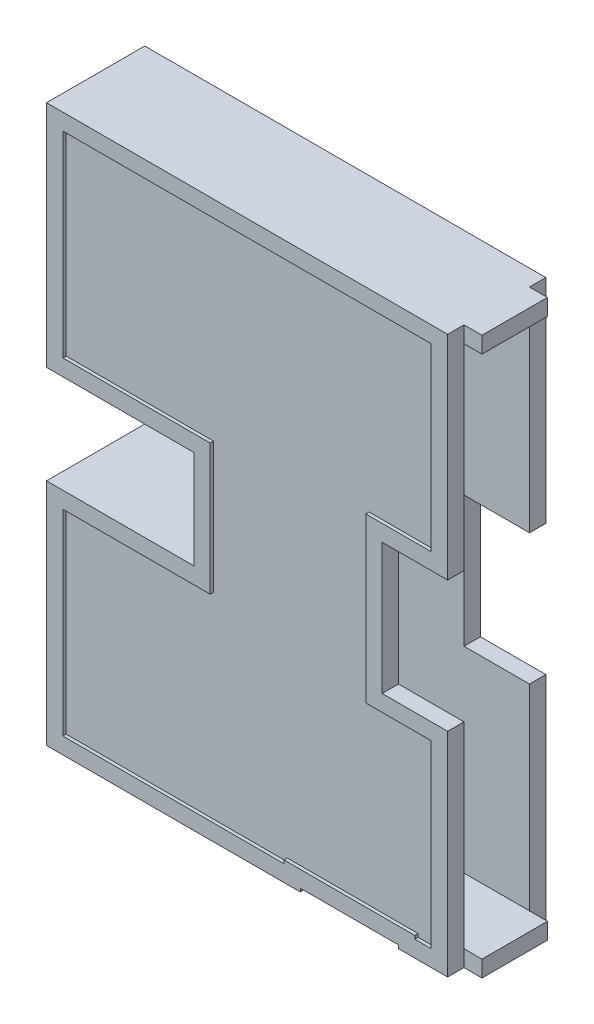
from build123d import *

# Parameters (mm, degrees)
BOSS_EXTRU_1_DEPTH      = 15
ENL_V_MAT_EXTRU_1_DEPTH = 1
ESQUISSE3_W             = 20
ESQUISSE3_H             = 160
ENL_V_MAT_EXTRU_2_DEPTH = 78
ESQUISSE4_W             = 20
ESQUISSE4_H             = 60
ENL_V_MAT_EXTRU_3_DEPTH = 45
ESQUISSE5_W             = 5.5
ESQUISSE5_H             = 5
ENL_V_MAT_EXTRU_4_DEPTH = 214.32838536


with BuildPart() as part:
    # Esquisse1 → Boss.-Extru.1 (new body)
    with BuildSketch(Plane.XY):
        Polygon((0, 0), (77.5, 0), (77.5, 1), (107.5, 1), (107.5, 0), (128, 0), (128, 5), (122.5, 5), (122.5, 65), (102.5, 65), (102.5, 105), (122.5, 105), (122.5, 165), (128, 165), (128, 170), (0, 170), (0, 100), (45, 100), (45, 70), (0, 70), align=None)
    boss_extru_1 = extrude(amount=BOSS_EXTRU_1_DEPTH)

    # Esquisse2 → Enl_v. mat.-Extru.1 (cut)
    with BuildSketch(Plane.XY.offset(15)):
        Polygon((117.5, 165), (5, 165), (5, 105), (50, 105), (50, 65), (5, 65), (5, 5), (72.5, 5), (72.5, 6), (112.5, 6), (112.5, 5), (117.5, 5), (117.5, 60), (97.5, 60), (97.5, 110), (117.5, 110), align=None)
    enl_v_mat_extru_1 = extrude(amount=-ENL_V_MAT_EXTRU_1_DEPTH, mode=Mode.SUBTRACT)

    # Sym_trie1: Boss.-Extru.1, Enl_v. mat.-Extru.1 across plane
    add(boss_extru_1.mirror(Plane.XY))
    add(enl_v_mat_extru_1.mirror(Plane.XY), mode=Mode.SUBTRACT)

    # Esquisse3 → Enl_v. mat.-Extru.2 (cut)
    with BuildSketch(Plane(origin=(128, 0, 0), x_dir=(0, 0, -1), z_dir=(1, 0, 0))):
        with Locations((0, 85)):
            Rectangle(ESQUISSE3_W, ESQUISSE3_H)
    extrude(amount=-ENL_V_MAT_EXTRU_2_DEPTH, mode=Mode.SUBTRACT)

    # Esquisse4 → Enl_v. mat.-Extru.3 (cut)
    with BuildSketch(Plane(origin=(50, 0, 0), x_dir=(0, 0, -1), z_dir=(1, 0, 0))):
        with Locations((0, 135)):
            Rectangle(ESQUISSE4_W, ESQUISSE4_H)
        with Locations((0, 35)):
            Rectangle(ESQUISSE4_W, ESQUISSE4_H)
    extrude(amount=-ENL_V_MAT_EXTRU_3_DEPTH, mode=Mode.SUBTRACT)

    # Esquisse5 → Enl_v. mat.-Extru.4 (cut, through all)
    with BuildSketch(Plane.XZ):
        with Locations((125.25, 12.5)):
            Rectangle(ESQUISSE5_W, ESQUISSE5_H)
        with Locations((125.25, -12.5)):
            Rectangle(ESQUISSE5_W, ESQUISSE5_H)
    extrude(amount=-ENL_V_MAT_EXTRU_4_DEPTH, mode=Mode.SUBTRACT)


solid = part.part
